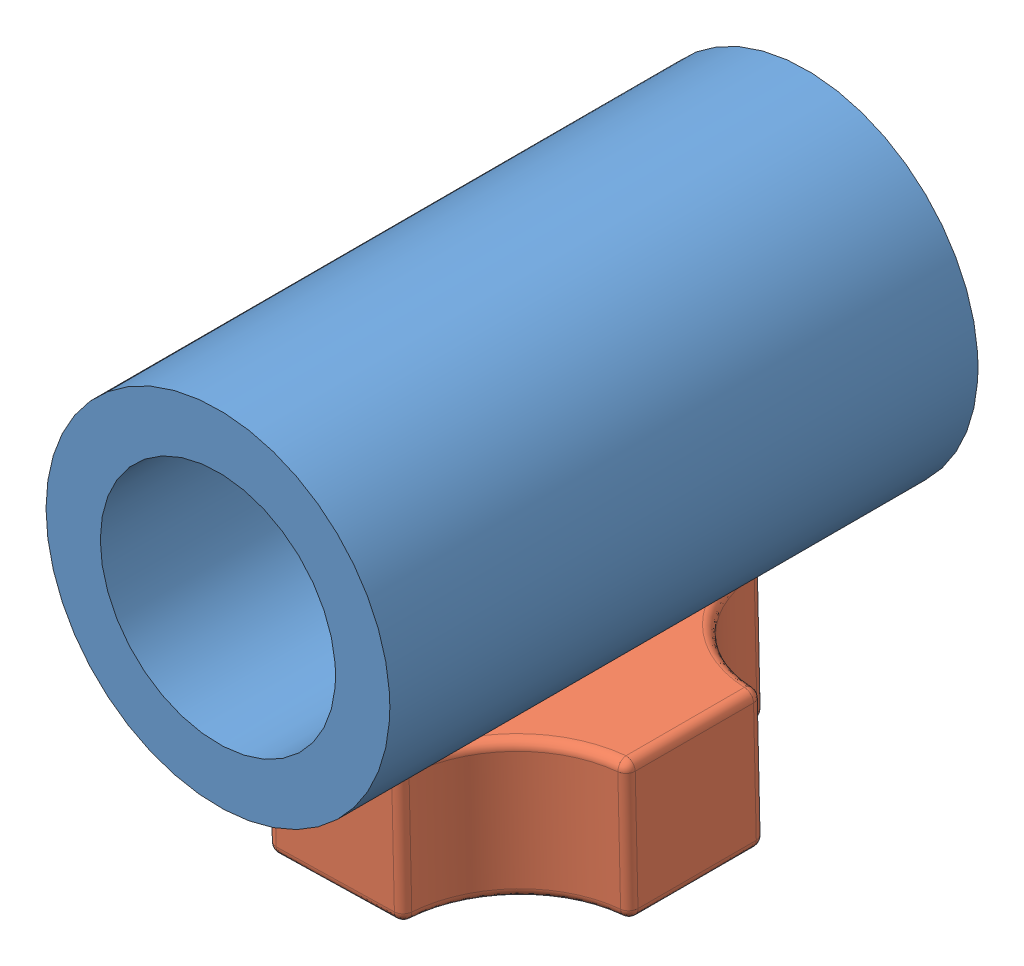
SolidWorks assembly slider_and_knob.SLDASM, configuration Default (file format 4700). Lengths in mm.
Overall size (40.57 53.48 65).
2 component instances, 2 part files, 2 mates.
Components (placement in the parent):
- slider_lower-1: slider_lower.SLDPRT [Default] at (-0.2251 11.2616 -57.5322) size (38 38 65)
- knob-1: knob.SLDPRT [Default] at (-0.7404 -22.7594 -26.0358) x (0 0 -1) z (-0.023172 0.999731 0) size (40 40 25)
Mates (geometry in assembly coordinates):
- Tangent2: tangent: cylinder of slider_lower-1 through (-0.2251 11.2616 7.4678) axis (0 0 -1) radius 19; plane of knob-1 through (-21.0826 -8.2269 -46.0358) normal (-0.023172 0.999731 0)
- Lock2: lock: unknown of slider_lower-1; unknown of knob-1
